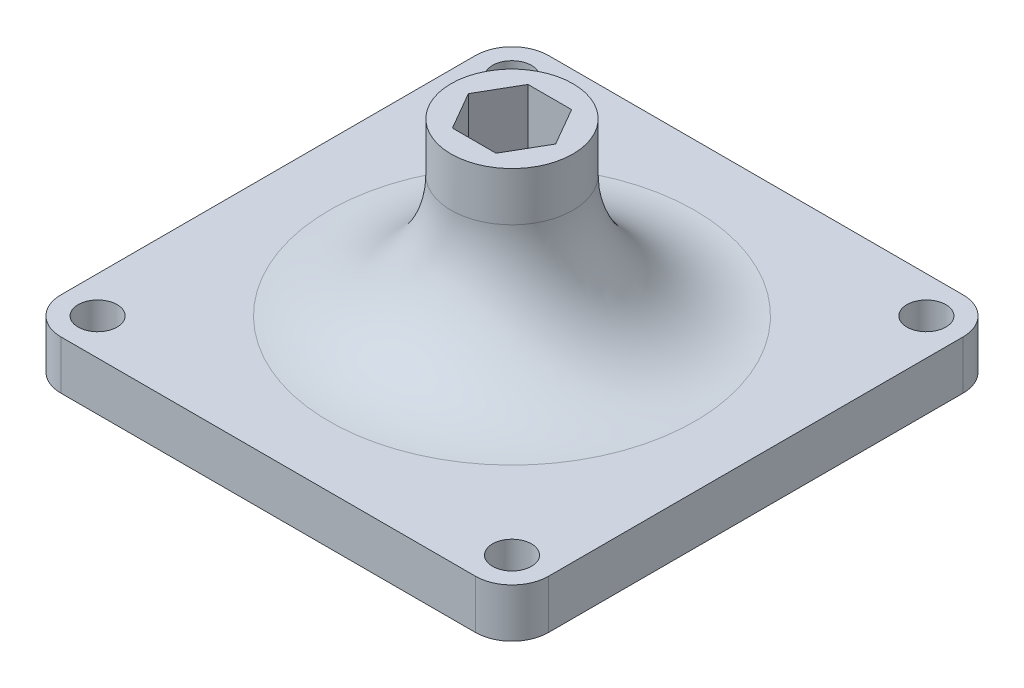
from build123d import *

# Parameters (mm, degrees)
SKETCH_1_R          = 1.6
EXTRUDE_1_DEPTH     = 4
SKETCH_2_R          = 5
EXTRUDE_2_DEPTH     = 14
FILLET_1_R          = 10
CUT_EXTRUDE_1_DEPTH = 8
SKETCH_4_R          = 3.75
CUT_EXTRUDE_2_DEPTH = 5
SKETCH_5_R          = 2.1
CUT_EXTRUDE_3_DEPTH = 32.128764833


with BuildPart() as part:
    # Sketch 1 → Extrude 1 (new body)
    with BuildSketch(Plane(origin=(0, 0, 0), x_dir=(1, 0, 0), z_dir=(0, 1, 0))):
        with BuildLine():
            Line((-17, 20), (17, 20))
            ThreePointArc((17, 20), (19.121320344, 19.121320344), (20, 17))
            Line((20, 17), (20, -17))
            ThreePointArc((20, -17), (19.121320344, -19.121320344), (17, -20))
            Line((17, -20), (-17, -20))
            ThreePointArc((-17, -20), (-19.121320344, -19.121320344), (-20, -17))
            Line((-20, -17), (-20, 17))
            ThreePointArc((-20, 17), (-19.121320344, 19.121320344), (-17, 20))
        make_face()
        with Locations(Location((-17, 17, 0), (0, 0, 270))):
            Circle(SKETCH_1_R, mode=Mode.SUBTRACT)
        with Locations(Location((17, 17, 0), (0, 0, 270))):
            Circle(SKETCH_1_R, mode=Mode.SUBTRACT)
        with Locations(Location((17, -17, 0), (0, 0, 270))):
            Circle(SKETCH_1_R, mode=Mode.SUBTRACT)
        with Locations(Location((-17, -17, 0), (0, 0, 270))):
            Circle(SKETCH_1_R, mode=Mode.SUBTRACT)
    extrude(amount=EXTRUDE_1_DEPTH)

    # Sketch 2 → Extrude 2 (add)
    with BuildSketch(Plane(origin=(0, 4, 0), x_dir=(1, 0, 0), z_dir=(0, 1, 0))):
        with Locations(Location((0, 0, 0), (0, 0, 90))):
            Circle(SKETCH_2_R)
    extrude(amount=EXTRUDE_2_DEPTH)

    # Fillet 1
    fillet_1_edges = [part.edges().sort_by_distance(p)[0] for p in [
        (0, 4, 5),
    ]]
    fillet(fillet_1_edges, radius=FILLET_1_R)

    # Sketch 3 → Cut-Extrude 1 (cut)
    with BuildSketch(Plane(origin=(0, 18, 0), x_dir=(1, 0, 0), z_dir=(0, 1, 0))):
        Polygon((3.579571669, 0), (1.789785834, 3.1), (-1.789785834, 3.1), (-3.579571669, 0), (-1.789785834, -3.1), (1.789785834, -3.1), align=None)
    extrude(amount=-CUT_EXTRUDE_1_DEPTH, mode=Mode.SUBTRACT)

    # Sketch 4 → Cut-Extrude 2 (cut)
    with BuildSketch(Plane.XZ):
        with Locations(Location((0, 0, 0), (0, 0, 270))):
            Circle(SKETCH_4_R)
    extrude(amount=-CUT_EXTRUDE_2_DEPTH, mode=Mode.SUBTRACT)

    # Sketch 5 → Cut-Extrude 3 (cut, through all)
    with BuildSketch(Plane.XZ.offset(-5)):
        with Locations(Location((0, 0, 0), (0, 0, 270))):
            Circle(SKETCH_5_R)
    extrude(amount=-CUT_EXTRUDE_3_DEPTH, mode=Mode.SUBTRACT)


solid = part.part
